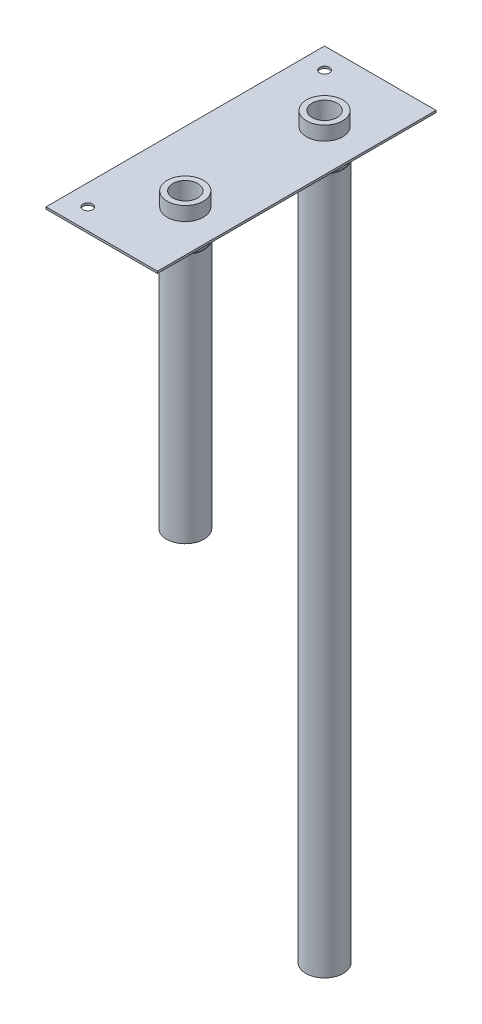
ISO-10303-21;
HEADER;
FILE_DESCRIPTION(('STEP AP214'),'2;1');
FILE_NAME('part.step','',(''),(''),'','','');
FILE_SCHEMA(('AUTOMOTIVE_DESIGN { 1 0 10303 214 1 1 1 1 }'));
ENDSEC;
DATA;
#1=APPLICATION_CONTEXT('core data for automotive mechanical design processes');
#2=APPLICATION_PROTOCOL_DEFINITION('international standard','automotive_design',2000,#1);
#3=PRODUCT_CONTEXT('',#1,'mechanical');
#4=PRODUCT('Part','Part','',(#3));
#5=PRODUCT_RELATED_PRODUCT_CATEGORY('part','',(#4));
#6=PRODUCT_DEFINITION_FORMATION('','',#4);
#7=PRODUCT_DEFINITION_CONTEXT('part definition',#1,'design');
#8=PRODUCT_DEFINITION('design','',#6,#7);
#9=PRODUCT_DEFINITION_SHAPE('','',#8);
#10=(LENGTH_UNIT() NAMED_UNIT(*) SI_UNIT(.MILLI.,.METRE.));
#11=(NAMED_UNIT(*) PLANE_ANGLE_UNIT() SI_UNIT($,.RADIAN.));
#12=(NAMED_UNIT(*) SI_UNIT($,.STERADIAN.) SOLID_ANGLE_UNIT());
#13=UNCERTAINTY_MEASURE_WITH_UNIT(LENGTH_MEASURE(1.E-05),#10,'distance_accuracy_value','');
#14=(GEOMETRIC_REPRESENTATION_CONTEXT(3) GLOBAL_UNCERTAINTY_ASSIGNED_CONTEXT((#13)) GLOBAL_UNIT_ASSIGNED_CONTEXT((#10,
#11,#12)) REPRESENTATION_CONTEXT('',''));
#15=CARTESIAN_POINT('',(0.,0.,0.));
#16=DIRECTION('',(0.,0.,1.));
#17=DIRECTION('',(1.,0.,0.));
#18=AXIS2_PLACEMENT_3D('',#15,#16,#17);
#19=CARTESIAN_POINT('',(0.,0.,-200.));
#20=DIRECTION('',(-1.,0.,0.));
#21=DIRECTION('',(0.,-1.,0.));
#22=AXIS2_PLACEMENT_3D('',#19,#20,#21);
#23=PLANE('',#22);
#24=DIRECTION('',(0.,-1.,0.));
#25=VECTOR('',#24,1.);
#26=CARTESIAN_POINT('',(0.,0.,0.));
#27=LINE('',#26,#25);
#28=CARTESIAN_POINT('',(0.,0.,0.));
#29=VERTEX_POINT('',#28);
#30=CARTESIAN_POINT('',(0.,-1.5,0.));
#31=VERTEX_POINT('',#30);
#32=EDGE_CURVE('E101',#29,#31,#27,.T.);
#33=ORIENTED_EDGE('',*,*,#32,.F.);
#34=DIRECTION('',(0.,0.,1.));
#35=VECTOR('',#34,1.);
#36=CARTESIAN_POINT('',(0.,0.,-200.));
#37=LINE('',#36,#35);
#38=CARTESIAN_POINT('',(0.,0.,-200.));
#39=VERTEX_POINT('',#38);
#40=EDGE_CURVE('E11',#39,#29,#37,.T.);
#41=ORIENTED_EDGE('',*,*,#40,.F.);
#42=DIRECTION('',(0.,-1.,0.));
#43=VECTOR('',#42,1.);
#44=CARTESIAN_POINT('',(0.,0.,-200.));
#45=LINE('',#44,#43);
#46=CARTESIAN_POINT('',(0.,-1.5,-200.));
#47=VERTEX_POINT('',#46);
#48=EDGE_CURVE('E94',#39,#47,#45,.T.);
#49=ORIENTED_EDGE('',*,*,#48,.T.);
#50=DIRECTION('',(0.,0.,1.));
#51=VECTOR('',#50,1.);
#52=CARTESIAN_POINT('',(0.,-1.5,-200.));
#53=LINE('',#52,#51);
#54=EDGE_CURVE('E39',#47,#31,#53,.T.);
#55=ORIENTED_EDGE('',*,*,#54,.T.);
#56=EDGE_LOOP('',(#33,#41,#49,#55));
#57=FACE_BOUND('',#56,.T.);
#58=ADVANCED_FACE('F36',(#57),#23,.T.);
#59=CARTESIAN_POINT('',(0.,0.,-200.));
#60=DIRECTION('',(0.,1.,0.));
#61=DIRECTION('',(0.,0.,1.));
#62=AXIS2_PLACEMENT_3D('',#59,#60,#61);
#63=PLANE('',#62);
#64=CARTESIAN_POINT('',(15.,0.,-185.));
#65=DIRECTION('',(0.,1.,0.));
#66=DIRECTION('',(0.,0.,1.));
#67=AXIS2_PLACEMENT_3D('',#64,#65,#66);
#68=CIRCLE('',#67,3.50000000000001);
#69=CARTESIAN_POINT('',(15.,0.,-181.5));
#70=VERTEX_POINT('',#69);
#71=EDGE_CURVE('E148',#70,#70,#68,.T.);
#72=ORIENTED_EDGE('',*,*,#71,.F.);
#73=EDGE_LOOP('',(#72));
#74=FACE_BOUND('',#73,.T.);
#75=CARTESIAN_POINT('',(15.,0.,-15.));
#76=DIRECTION('',(0.,1.,0.));
#77=DIRECTION('',(0.,0.,1.));
#78=AXIS2_PLACEMENT_3D('',#75,#76,#77);
#79=CIRCLE('',#78,3.5);
#80=CARTESIAN_POINT('',(15.,0.,-11.5));
#81=VERTEX_POINT('',#80);
#82=EDGE_CURVE('E157',#81,#81,#79,.T.);
#83=ORIENTED_EDGE('',*,*,#82,.F.);
#84=EDGE_LOOP('',(#83));
#85=FACE_BOUND('',#84,.T.);
#86=CARTESIAN_POINT('',(50.,0.,-150.));
#87=DIRECTION('',(0.,1.,0.));
#88=DIRECTION('',(0.,0.,1.));
#89=AXIS2_PLACEMENT_3D('',#86,#87,#88);
#90=CIRCLE('',#89,13.);
#91=CARTESIAN_POINT('',(50.,0.,-137.));
#92=VERTEX_POINT('',#91);
#93=EDGE_CURVE('E160',#92,#92,#90,.T.);
#94=ORIENTED_EDGE('',*,*,#93,.F.);
#95=EDGE_LOOP('',(#94));
#96=FACE_BOUND('',#95,.T.);
#97=CARTESIAN_POINT('',(50.,0.,-50.));
#98=DIRECTION('',(0.,1.,0.));
#99=DIRECTION('',(0.,0.,1.));
#100=AXIS2_PLACEMENT_3D('',#97,#98,#99);
#101=CIRCLE('',#100,13.);
#102=CARTESIAN_POINT('',(50.,0.,-37.));
#103=VERTEX_POINT('',#102);
#104=EDGE_CURVE('E105',#103,#103,#101,.T.);
#105=ORIENTED_EDGE('',*,*,#104,.F.);
#106=EDGE_LOOP('',(#105));
#107=FACE_BOUND('',#106,.T.);
#108=DIRECTION('',(-1.,0.,0.));
#109=VECTOR('',#108,1.);
#110=CARTESIAN_POINT('',(0.,0.,0.));
#111=LINE('',#110,#109);
#112=CARTESIAN_POINT('',(80.,0.,0.));
#113=VERTEX_POINT('',#112);
#114=EDGE_CURVE('E96',#113,#29,#111,.T.);
#115=ORIENTED_EDGE('',*,*,#114,.F.);
#116=DIRECTION('',(0.,0.,1.));
#117=VECTOR('',#116,1.);
#118=CARTESIAN_POINT('',(80.,0.,-200.));
#119=LINE('',#118,#117);
#120=CARTESIAN_POINT('',(80.,0.,-200.));
#121=VERTEX_POINT('',#120);
#122=EDGE_CURVE('E45',#121,#113,#119,.T.);
#123=ORIENTED_EDGE('',*,*,#122,.F.);
#124=DIRECTION('',(-1.,0.,0.));
#125=VECTOR('',#124,1.);
#126=CARTESIAN_POINT('',(0.,0.,-200.));
#127=LINE('',#126,#125);
#128=EDGE_CURVE('E91',#121,#39,#127,.T.);
#129=ORIENTED_EDGE('',*,*,#128,.T.);
#130=ORIENTED_EDGE('',*,*,#40,.T.);
#131=EDGE_LOOP('',(#115,#123,#129,#130));
#132=FACE_BOUND('',#131,.T.);
#133=ADVANCED_FACE('F112',(#74,#85,#96,#107,#132),#63,.T.);
#134=CARTESIAN_POINT('',(80.,-1.5,-200.));
#135=DIRECTION('',(1.,0.,0.));
#136=DIRECTION('',(0.,0.,-1.));
#137=AXIS2_PLACEMENT_3D('',#134,#135,#136);
#138=PLANE('',#137);
#139=DIRECTION('',(0.,1.,0.));
#140=VECTOR('',#139,1.);
#141=CARTESIAN_POINT('',(80.,-1.5,0.));
#142=LINE('',#141,#140);
#143=CARTESIAN_POINT('',(80.,-1.5,0.));
#144=VERTEX_POINT('',#143);
#145=EDGE_CURVE('E86',#144,#113,#142,.T.);
#146=ORIENTED_EDGE('',*,*,#145,.F.);
#147=DIRECTION('',(0.,0.,1.));
#148=VECTOR('',#147,1.);
#149=CARTESIAN_POINT('',(80.,-1.5,-200.));
#150=LINE('',#149,#148);
#151=CARTESIAN_POINT('',(80.,-1.5,-200.));
#152=VERTEX_POINT('',#151);
#153=EDGE_CURVE('E81',#152,#144,#150,.T.);
#154=ORIENTED_EDGE('',*,*,#153,.F.);
#155=DIRECTION('',(0.,1.,0.));
#156=VECTOR('',#155,1.);
#157=CARTESIAN_POINT('',(80.,-1.5,-200.));
#158=LINE('',#157,#156);
#159=EDGE_CURVE('E84',#152,#121,#158,.T.);
#160=ORIENTED_EDGE('',*,*,#159,.T.);
#161=ORIENTED_EDGE('',*,*,#122,.T.);
#162=EDGE_LOOP('',(#146,#154,#160,#161));
#163=FACE_BOUND('',#162,.T.);
#164=ADVANCED_FACE('F83',(#163),#138,.T.);
#165=CARTESIAN_POINT('',(0.,-1.5,-200.));
#166=DIRECTION('',(0.,-1.,0.));
#167=DIRECTION('',(1.,0.,0.));
#168=AXIS2_PLACEMENT_3D('',#165,#166,#167);
#169=PLANE('',#168);
#170=CARTESIAN_POINT('',(15.,-1.5,-185.));
#171=DIRECTION('',(0.,-1.,0.));
#172=DIRECTION('',(1.,0.,0.));
#173=AXIS2_PLACEMENT_3D('',#170,#171,#172);
#174=CIRCLE('',#173,3.50000000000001);
#175=CARTESIAN_POINT('',(18.5,-1.5,-185.));
#176=VERTEX_POINT('',#175);
#177=EDGE_CURVE('E133',#176,#176,#174,.F.);
#178=ORIENTED_EDGE('',*,*,#177,.T.);
#179=EDGE_LOOP('',(#178));
#180=FACE_BOUND('',#179,.T.);
#181=CARTESIAN_POINT('',(15.,-1.5,-15.));
#182=DIRECTION('',(0.,-1.,0.));
#183=DIRECTION('',(1.,0.,0.));
#184=AXIS2_PLACEMENT_3D('',#181,#182,#183);
#185=CIRCLE('',#184,3.5);
#186=CARTESIAN_POINT('',(18.5,-1.5,-15.));
#187=VERTEX_POINT('',#186);
#188=EDGE_CURVE('E137',#187,#187,#185,.F.);
#189=ORIENTED_EDGE('',*,*,#188,.T.);
#190=EDGE_LOOP('',(#189));
#191=FACE_BOUND('',#190,.T.);
#192=CARTESIAN_POINT('',(50.,-1.5,-150.));
#193=DIRECTION('',(0.,-1.,0.));
#194=DIRECTION('',(1.,0.,0.));
#195=AXIS2_PLACEMENT_3D('',#192,#193,#194);
#196=CIRCLE('',#195,13.);
#197=CARTESIAN_POINT('',(63.,-1.5,-150.));
#198=VERTEX_POINT('',#197);
#199=EDGE_CURVE('E141',#198,#198,#196,.T.);
#200=ORIENTED_EDGE('',*,*,#199,.F.);
#201=EDGE_LOOP('',(#200));
#202=FACE_BOUND('',#201,.T.);
#203=CARTESIAN_POINT('',(50.,-1.5,-50.));
#204=DIRECTION('',(0.,-1.,0.));
#205=DIRECTION('',(1.,0.,0.));
#206=AXIS2_PLACEMENT_3D('',#203,#204,#205);
#207=CIRCLE('',#206,13.);
#208=CARTESIAN_POINT('',(63.,-1.5,-50.));
#209=VERTEX_POINT('',#208);
#210=EDGE_CURVE('E144',#209,#209,#207,.T.);
#211=ORIENTED_EDGE('',*,*,#210,.F.);
#212=EDGE_LOOP('',(#211));
#213=FACE_BOUND('',#212,.T.);
#214=DIRECTION('',(1.,0.,0.));
#215=VECTOR('',#214,1.);
#216=CARTESIAN_POINT('',(0.,-1.5,0.));
#217=LINE('',#216,#215);
#218=EDGE_CURVE('E104',#31,#144,#217,.T.);
#219=ORIENTED_EDGE('',*,*,#218,.F.);
#220=ORIENTED_EDGE('',*,*,#54,.F.);
#221=DIRECTION('',(1.,0.,0.));
#222=VECTOR('',#221,1.);
#223=CARTESIAN_POINT('',(0.,-1.5,-200.));
#224=LINE('',#223,#222);
#225=EDGE_CURVE('E90',#47,#152,#224,.T.);
#226=ORIENTED_EDGE('',*,*,#225,.T.);
#227=ORIENTED_EDGE('',*,*,#153,.T.);
#228=EDGE_LOOP('',(#219,#220,#226,#227));
#229=FACE_BOUND('',#228,.T.);
#230=ADVANCED_FACE('F93',(#180,#191,#202,#213,#229),#169,.T.);
#231=CARTESIAN_POINT('',(0.,-1.5,-200.));
#232=DIRECTION('',(0.,0.,1.));
#233=DIRECTION('',(1.,0.,0.));
#234=AXIS2_PLACEMENT_3D('',#231,#232,#233);
#235=PLANE('',#234);
#236=ORIENTED_EDGE('',*,*,#48,.F.);
#237=ORIENTED_EDGE('',*,*,#128,.F.);
#238=ORIENTED_EDGE('',*,*,#159,.F.);
#239=ORIENTED_EDGE('',*,*,#225,.F.);
#240=EDGE_LOOP('',(#236,#237,#238,#239));
#241=FACE_BOUND('',#240,.T.);
#242=ADVANCED_FACE('F89',(#241),#235,.F.);
#243=CARTESIAN_POINT('',(0.,-1.5,0.));
#244=DIRECTION('',(0.,0.,1.));
#245=DIRECTION('',(1.,0.,0.));
#246=AXIS2_PLACEMENT_3D('',#243,#244,#245);
#247=PLANE('',#246);
#248=ORIENTED_EDGE('',*,*,#32,.T.);
#249=ORIENTED_EDGE('',*,*,#218,.T.);
#250=ORIENTED_EDGE('',*,*,#145,.T.);
#251=ORIENTED_EDGE('',*,*,#114,.T.);
#252=EDGE_LOOP('',(#248,#249,#250,#251));
#253=FACE_BOUND('',#252,.T.);
#254=ADVANCED_FACE('F111',(#253),#247,.T.);
#255=CARTESIAN_POINT('',(15.,-1.501,-15.));
#256=DIRECTION('',(0.,1.,0.));
#257=DIRECTION('',(0.,0.,1.));
#258=AXIS2_PLACEMENT_3D('',#255,#256,#257);
#259=CYLINDRICAL_SURFACE('',#258,3.5);
#260=ORIENTED_EDGE('',*,*,#188,.F.);
#261=EDGE_LOOP('',(#260));
#262=FACE_BOUND('',#261,.T.);
#263=ORIENTED_EDGE('',*,*,#82,.T.);
#264=EDGE_LOOP('',(#263));
#265=FACE_BOUND('',#264,.T.);
#266=ADVANCED_FACE('F287',(#262,#265),#259,.F.);
#267=CARTESIAN_POINT('',(15.,-1.501,-185.));
#268=DIRECTION('',(0.,1.,0.));
#269=DIRECTION('',(0.,0.,1.));
#270=AXIS2_PLACEMENT_3D('',#267,#268,#269);
#271=CYLINDRICAL_SURFACE('',#270,3.50000000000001);
#272=ORIENTED_EDGE('',*,*,#177,.F.);
#273=EDGE_LOOP('',(#272));
#274=FACE_BOUND('',#273,.T.);
#275=ORIENTED_EDGE('',*,*,#71,.T.);
#276=EDGE_LOOP('',(#275));
#277=FACE_BOUND('',#276,.T.);
#278=ADVANCED_FACE('F171',(#274,#277),#271,.F.);
#279=CARTESIAN_POINT('',(50.,-20.,-50.));
#280=DIRECTION('',(0.,1.,0.));
#281=DIRECTION('',(0.,0.,1.));
#282=AXIS2_PLACEMENT_3D('',#279,#280,#281);
#283=CYLINDRICAL_SURFACE('',#282,13.);
#284=ORIENTED_EDGE('',*,*,#104,.T.);
#285=EDGE_LOOP('',(#284));
#286=FACE_BOUND('',#285,.T.);
#287=CARTESIAN_POINT('',(50.,10.,-50.));
#288=DIRECTION('',(0.,1.,0.));
#289=DIRECTION('',(0.,0.,1.));
#290=AXIS2_PLACEMENT_3D('',#287,#288,#289);
#291=CIRCLE('',#290,13.);
#292=CARTESIAN_POINT('',(50.,10.,-37.));
#293=VERTEX_POINT('',#292);
#294=EDGE_CURVE('E151',#293,#293,#291,.T.);
#295=ORIENTED_EDGE('',*,*,#294,.F.);
#296=EDGE_LOOP('',(#295));
#297=FACE_BOUND('',#296,.T.);
#298=ADVANCED_FACE('F166',(#286,#297),#283,.T.);
#299=ORIENTED_EDGE('',*,*,#210,.T.);
#300=EDGE_LOOP('',(#299));
#301=FACE_BOUND('',#300,.T.);
#302=CARTESIAN_POINT('',(50.,-20.,-50.));
#303=DIRECTION('',(0.,-1.,0.));
#304=DIRECTION('',(0.,0.,-1.));
#305=AXIS2_PLACEMENT_3D('',#302,#303,#304);
#306=CIRCLE('',#305,13.);
#307=CARTESIAN_POINT('',(50.,-20.,-63.));
#308=VERTEX_POINT('',#307);
#309=EDGE_CURVE('E190',#308,#308,#306,.F.);
#310=ORIENTED_EDGE('',*,*,#309,.T.);
#311=EDGE_LOOP('',(#310));
#312=FACE_BOUND('',#311,.T.);
#313=ADVANCED_FACE('F170',(#301,#312),#283,.T.);
#314=CARTESIAN_POINT('',(50.,-20.,-50.));
#315=DIRECTION('',(0.,1.,0.));
#316=DIRECTION('',(0.,0.,1.));
#317=AXIS2_PLACEMENT_3D('',#314,#315,#316);
#318=PLANE('',#317);
#319=CARTESIAN_POINT('',(50.,-20.,-50.));
#320=DIRECTION('',(0.,-1.,0.));
#321=DIRECTION('',(0.,0.,-1.));
#322=AXIS2_PLACEMENT_3D('',#319,#320,#321);
#323=CIRCLE('',#322,10.85);
#324=CARTESIAN_POINT('',(50.,-20.,-39.15));
#325=VERTEX_POINT('',#324);
#326=EDGE_CURVE('E200',#325,#325,#323,.T.);
#327=ORIENTED_EDGE('',*,*,#326,.T.);
#328=EDGE_LOOP('',(#327));
#329=FACE_BOUND('',#328,.T.);
#330=CARTESIAN_POINT('',(50.,-20.,-50.));
#331=DIRECTION('',(0.,1.,0.));
#332=DIRECTION('',(0.,0.,1.));
#333=AXIS2_PLACEMENT_3D('',#330,#331,#332);
#334=CIRCLE('',#333,9.);
#335=CARTESIAN_POINT('',(50.,-20.,-41.));
#336=VERTEX_POINT('',#335);
#337=EDGE_CURVE('E146',#336,#336,#334,.T.);
#338=ORIENTED_EDGE('',*,*,#337,.T.);
#339=EDGE_LOOP('',(#338));
#340=FACE_BOUND('',#339,.T.);
#341=ADVANCED_FACE('F279',(#329,#340),#318,.F.);
#342=CARTESIAN_POINT('',(50.,-20.,-50.));
#343=DIRECTION('',(0.,1.,0.));
#344=DIRECTION('',(0.,0.,1.));
#345=AXIS2_PLACEMENT_3D('',#342,#343,#344);
#346=CYLINDRICAL_SURFACE('',#345,9.);
#347=ORIENTED_EDGE('',*,*,#337,.F.);
#348=EDGE_LOOP('',(#347));
#349=FACE_BOUND('',#348,.T.);
#350=CARTESIAN_POINT('',(50.,10.,-50.));
#351=DIRECTION('',(0.,1.,0.));
#352=DIRECTION('',(0.,0.,1.));
#353=AXIS2_PLACEMENT_3D('',#350,#351,#352);
#354=CIRCLE('',#353,9.);
#355=CARTESIAN_POINT('',(50.,10.,-41.));
#356=VERTEX_POINT('',#355);
#357=EDGE_CURVE('E176',#356,#356,#354,.T.);
#358=ORIENTED_EDGE('',*,*,#357,.T.);
#359=EDGE_LOOP('',(#358));
#360=FACE_BOUND('',#359,.T.);
#361=ADVANCED_FACE('F276',(#349,#360),#346,.F.);
#362=CARTESIAN_POINT('',(50.,10.,-50.));
#363=DIRECTION('',(0.,1.,0.));
#364=DIRECTION('',(0.,0.,1.));
#365=AXIS2_PLACEMENT_3D('',#362,#363,#364);
#366=PLANE('',#365);
#367=ORIENTED_EDGE('',*,*,#294,.T.);
#368=EDGE_LOOP('',(#367));
#369=FACE_BOUND('',#368,.T.);
#370=ORIENTED_EDGE('',*,*,#357,.F.);
#371=EDGE_LOOP('',(#370));
#372=FACE_BOUND('',#371,.T.);
#373=ADVANCED_FACE('F273',(#369,#372),#366,.T.);
#374=CARTESIAN_POINT('',(50.,-20.,-150.));
#375=DIRECTION('',(0.,1.,0.));
#376=DIRECTION('',(0.,0.,1.));
#377=AXIS2_PLACEMENT_3D('',#374,#375,#376);
#378=CYLINDRICAL_SURFACE('',#377,13.);
#379=ORIENTED_EDGE('',*,*,#93,.T.);
#380=EDGE_LOOP('',(#379));
#381=FACE_BOUND('',#380,.T.);
#382=CARTESIAN_POINT('',(50.,10.,-150.));
#383=DIRECTION('',(0.,1.,0.));
#384=DIRECTION('',(0.,0.,1.));
#385=AXIS2_PLACEMENT_3D('',#382,#383,#384);
#386=CIRCLE('',#385,13.);
#387=CARTESIAN_POINT('',(50.,10.,-137.));
#388=VERTEX_POINT('',#387);
#389=EDGE_CURVE('E184',#388,#388,#386,.T.);
#390=ORIENTED_EDGE('',*,*,#389,.F.);
#391=EDGE_LOOP('',(#390));
#392=FACE_BOUND('',#391,.T.);
#393=ADVANCED_FACE('F271',(#381,#392),#378,.T.);
#394=ORIENTED_EDGE('',*,*,#199,.T.);
#395=EDGE_LOOP('',(#394));
#396=FACE_BOUND('',#395,.T.);
#397=CARTESIAN_POINT('',(50.,-20.,-150.));
#398=DIRECTION('',(0.,-1.,0.));
#399=DIRECTION('',(0.,0.,-1.));
#400=AXIS2_PLACEMENT_3D('',#397,#398,#399);
#401=CIRCLE('',#400,13.);
#402=CARTESIAN_POINT('',(50.,-20.,-163.));
#403=VERTEX_POINT('',#402);
#404=EDGE_CURVE('E203',#403,#403,#401,.F.);
#405=ORIENTED_EDGE('',*,*,#404,.T.);
#406=EDGE_LOOP('',(#405));
#407=FACE_BOUND('',#406,.T.);
#408=ADVANCED_FACE('F267',(#396,#407),#378,.T.);
#409=CARTESIAN_POINT('',(50.,-20.,-150.));
#410=DIRECTION('',(0.,1.,0.));
#411=DIRECTION('',(0.,0.,1.));
#412=AXIS2_PLACEMENT_3D('',#409,#410,#411);
#413=PLANE('',#412);
#414=CARTESIAN_POINT('',(50.,-20.,-150.));
#415=DIRECTION('',(0.,-1.,0.));
#416=DIRECTION('',(0.,0.,-1.));
#417=AXIS2_PLACEMENT_3D('',#414,#415,#416);
#418=CIRCLE('',#417,10.85);
#419=CARTESIAN_POINT('',(50.,-20.,-160.85));
#420=VERTEX_POINT('',#419);
#421=EDGE_CURVE('E215',#420,#420,#418,.T.);
#422=ORIENTED_EDGE('',*,*,#421,.T.);
#423=EDGE_LOOP('',(#422));
#424=FACE_BOUND('',#423,.T.);
#425=CARTESIAN_POINT('',(50.,-20.,-150.));
#426=DIRECTION('',(0.,1.,0.));
#427=DIRECTION('',(0.,0.,1.));
#428=AXIS2_PLACEMENT_3D('',#425,#426,#427);
#429=CIRCLE('',#428,9.00000000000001);
#430=CARTESIAN_POINT('',(50.,-20.,-141.));
#431=VERTEX_POINT('',#430);
#432=EDGE_CURVE('E181',#431,#431,#429,.T.);
#433=ORIENTED_EDGE('',*,*,#432,.T.);
#434=EDGE_LOOP('',(#433));
#435=FACE_BOUND('',#434,.T.);
#436=ADVANCED_FACE('F263',(#424,#435),#413,.F.);
#437=CARTESIAN_POINT('',(50.,-20.,-150.));
#438=DIRECTION('',(0.,1.,0.));
#439=DIRECTION('',(0.,0.,1.));
#440=AXIS2_PLACEMENT_3D('',#437,#438,#439);
#441=CYLINDRICAL_SURFACE('',#440,9.00000000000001);
#442=ORIENTED_EDGE('',*,*,#432,.F.);
#443=EDGE_LOOP('',(#442));
#444=FACE_BOUND('',#443,.T.);
#445=CARTESIAN_POINT('',(50.,10.,-150.));
#446=DIRECTION('',(0.,1.,0.));
#447=DIRECTION('',(0.,0.,1.));
#448=AXIS2_PLACEMENT_3D('',#445,#446,#447);
#449=CIRCLE('',#448,9.00000000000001);
#450=CARTESIAN_POINT('',(50.,10.,-141.));
#451=VERTEX_POINT('',#450);
#452=EDGE_CURVE('E187',#451,#451,#449,.T.);
#453=ORIENTED_EDGE('',*,*,#452,.T.);
#454=EDGE_LOOP('',(#453));
#455=FACE_BOUND('',#454,.T.);
#456=ADVANCED_FACE('F259',(#444,#455),#441,.F.);
#457=CARTESIAN_POINT('',(50.,10.,-150.));
#458=DIRECTION('',(0.,1.,0.));
#459=DIRECTION('',(0.,0.,1.));
#460=AXIS2_PLACEMENT_3D('',#457,#458,#459);
#461=PLANE('',#460);
#462=ORIENTED_EDGE('',*,*,#389,.T.);
#463=EDGE_LOOP('',(#462));
#464=FACE_BOUND('',#463,.T.);
#465=ORIENTED_EDGE('',*,*,#452,.F.);
#466=EDGE_LOOP('',(#465));
#467=FACE_BOUND('',#466,.T.);
#468=ADVANCED_FACE('F249',(#464,#467),#461,.T.);
#469=CARTESIAN_POINT('',(50.,-200.,-50.));
#470=DIRECTION('',(0.,-1.,0.));
#471=DIRECTION('',(0.,0.,-1.));
#472=AXIS2_PLACEMENT_3D('',#469,#470,#471);
#473=PLANE('',#472);
#474=CARTESIAN_POINT('',(50.,-200.,-50.));
#475=DIRECTION('',(0.,-1.,0.));
#476=DIRECTION('',(0.,0.,-1.));
#477=AXIS2_PLACEMENT_3D('',#474,#475,#476);
#478=CIRCLE('',#477,13.45);
#479=CARTESIAN_POINT('',(50.,-200.,-36.55));
#480=VERTEX_POINT('',#479);
#481=EDGE_CURVE('E193',#480,#480,#478,.T.);
#482=ORIENTED_EDGE('',*,*,#481,.T.);
#483=EDGE_LOOP('',(#482));
#484=FACE_BOUND('',#483,.T.);
#485=CARTESIAN_POINT('',(50.,-200.,-50.));
#486=DIRECTION('',(0.,-1.,0.));
#487=DIRECTION('',(0.,0.,-1.));
#488=AXIS2_PLACEMENT_3D('',#485,#486,#487);
#489=CIRCLE('',#488,10.85);
#490=CARTESIAN_POINT('',(50.,-200.,-39.15));
#491=VERTEX_POINT('',#490);
#492=EDGE_CURVE('E197',#491,#491,#489,.T.);
#493=ORIENTED_EDGE('',*,*,#492,.F.);
#494=EDGE_LOOP('',(#493));
#495=FACE_BOUND('',#494,.T.);
#496=ADVANCED_FACE('F245',(#484,#495),#473,.T.);
#497=CARTESIAN_POINT('',(50.,-20.,-50.));
#498=DIRECTION('',(0.,-1.,0.));
#499=DIRECTION('',(0.,0.,-1.));
#500=AXIS2_PLACEMENT_3D('',#497,#498,#499);
#501=PLANE('',#500);
#502=ORIENTED_EDGE('',*,*,#309,.F.);
#503=EDGE_LOOP('',(#502));
#504=FACE_BOUND('',#503,.T.);
#505=CARTESIAN_POINT('',(50.,-20.,-50.));
#506=DIRECTION('',(0.,-1.,0.));
#507=DIRECTION('',(0.,0.,-1.));
#508=AXIS2_PLACEMENT_3D('',#505,#506,#507);
#509=CIRCLE('',#508,13.45);
#510=CARTESIAN_POINT('',(50.,-20.,-36.55));
#511=VERTEX_POINT('',#510);
#512=EDGE_CURVE('E194',#511,#511,#509,.T.);
#513=ORIENTED_EDGE('',*,*,#512,.F.);
#514=EDGE_LOOP('',(#513));
#515=FACE_BOUND('',#514,.T.);
#516=ADVANCED_FACE('F248',(#504,#515),#501,.F.);
#517=CARTESIAN_POINT('',(50.,-200.,-50.));
#518=DIRECTION('',(0.,1.,0.));
#519=DIRECTION('',(0.,0.,1.));
#520=AXIS2_PLACEMENT_3D('',#517,#518,#519);
#521=CYLINDRICAL_SURFACE('',#520,13.45);
#522=CARTESIAN_POINT('',(50.,-200.,-36.55));
#523=CARTESIAN_POINT('',(50.,-198.125,-36.55));
#524=CARTESIAN_POINT('',(50.,-196.25,-36.55));
#525=CARTESIAN_POINT('',(50.,-192.5,-36.55));
#526=CARTESIAN_POINT('',(50.,-190.625,-36.55));
#527=CARTESIAN_POINT('',(50.,-186.875,-36.55));
#528=CARTESIAN_POINT('',(50.,-185.,-36.55));
#529=CARTESIAN_POINT('',(50.,-181.25,-36.55));
#530=CARTESIAN_POINT('',(50.,-179.375,-36.55));
#531=CARTESIAN_POINT('',(50.,-175.625,-36.55));
#532=CARTESIAN_POINT('',(50.,-173.75,-36.55));
#533=CARTESIAN_POINT('',(50.,-170.,-36.55));
#534=CARTESIAN_POINT('',(50.,-168.125,-36.55));
#535=CARTESIAN_POINT('',(50.,-164.375,-36.55));
#536=CARTESIAN_POINT('',(50.,-162.5,-36.55));
#537=CARTESIAN_POINT('',(50.,-158.75,-36.55));
#538=CARTESIAN_POINT('',(50.,-156.875,-36.55));
#539=CARTESIAN_POINT('',(50.,-153.125,-36.55));
#540=CARTESIAN_POINT('',(50.,-151.25,-36.55));
#541=CARTESIAN_POINT('',(50.,-147.5,-36.55));
#542=CARTESIAN_POINT('',(50.,-145.625,-36.55));
#543=CARTESIAN_POINT('',(50.,-141.875,-36.55));
#544=CARTESIAN_POINT('',(50.,-140.,-36.55));
#545=CARTESIAN_POINT('',(50.,-136.25,-36.55));
#546=CARTESIAN_POINT('',(50.,-134.375,-36.55));
#547=CARTESIAN_POINT('',(50.,-130.625,-36.55));
#548=CARTESIAN_POINT('',(50.,-128.75,-36.55));
#549=CARTESIAN_POINT('',(50.,-125.,-36.55));
#550=CARTESIAN_POINT('',(50.,-123.125,-36.55));
#551=CARTESIAN_POINT('',(50.,-119.375,-36.55));
#552=CARTESIAN_POINT('',(50.,-117.5,-36.55));
#553=CARTESIAN_POINT('',(50.,-113.75,-36.55));
#554=CARTESIAN_POINT('',(50.,-111.875,-36.55));
#555=CARTESIAN_POINT('',(50.,-108.125,-36.55));
#556=CARTESIAN_POINT('',(50.,-106.25,-36.55));
#557=CARTESIAN_POINT('',(50.,-102.5,-36.55));
#558=CARTESIAN_POINT('',(50.,-100.625,-36.55));
#559=CARTESIAN_POINT('',(50.,-96.875,-36.55));
#560=CARTESIAN_POINT('',(50.,-95.,-36.55));
#561=CARTESIAN_POINT('',(50.,-91.25,-36.55));
#562=CARTESIAN_POINT('',(50.,-89.375,-36.55));
#563=CARTESIAN_POINT('',(50.,-85.625,-36.55));
#564=CARTESIAN_POINT('',(50.,-83.75,-36.55));
#565=CARTESIAN_POINT('',(50.,-80.,-36.55));
#566=CARTESIAN_POINT('',(50.,-78.125,-36.55));
#567=CARTESIAN_POINT('',(50.,-74.375,-36.55));
#568=CARTESIAN_POINT('',(50.,-72.5,-36.55));
#569=CARTESIAN_POINT('',(50.,-68.75,-36.55));
#570=CARTESIAN_POINT('',(50.,-66.875,-36.55));
#571=CARTESIAN_POINT('',(50.,-63.125,-36.55));
#572=CARTESIAN_POINT('',(50.,-61.25,-36.55));
#573=CARTESIAN_POINT('',(50.,-57.5,-36.55));
#574=CARTESIAN_POINT('',(50.,-55.625,-36.55));
#575=CARTESIAN_POINT('',(50.,-51.875,-36.55));
#576=CARTESIAN_POINT('',(50.,-50.,-36.55));
#577=CARTESIAN_POINT('',(50.,-46.25,-36.55));
#578=CARTESIAN_POINT('',(50.,-44.375,-36.55));
#579=CARTESIAN_POINT('',(50.,-40.625,-36.55));
#580=CARTESIAN_POINT('',(50.,-38.75,-36.55));
#581=CARTESIAN_POINT('',(50.,-35.,-36.55));
#582=CARTESIAN_POINT('',(50.,-33.125,-36.55));
#583=CARTESIAN_POINT('',(50.,-29.375,-36.55));
#584=CARTESIAN_POINT('',(50.,-27.5,-36.55));
#585=CARTESIAN_POINT('',(50.,-23.75,-36.55));
#586=CARTESIAN_POINT('',(50.,-21.875,-36.55));
#587=CARTESIAN_POINT('',(50.,-20.,-36.55));
#588=B_SPLINE_CURVE_WITH_KNOTS('',3,(#522,#523,#524,#525,#526,#527,#528,#529,#530,#531,#532,
#533,#534,#535,#536,#537,#538,#539,#540,#541,#542,#543,#544,#545,#546,#547,#548,#549,#550,#551,
#552,#553,#554,#555,#556,#557,#558,#559,#560,#561,#562,#563,#564,#565,#566,#567,#568,#569,#570,
#571,#572,#573,#574,#575,#576,#577,#578,#579,#580,#581,#582,#583,#584,#585,#586,#587),
.UNSPECIFIED.,.F.,.F.,(4,2,2,2,2,2,2,2,2,2,2,2,2,2,2,2,2,2,2,2,2,2,2,2,2,2,2,2,2,2,2,2,4),(0.,
5.62500000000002,11.25,16.875,22.5,28.125,33.75,39.375,45.,50.625,56.25,61.875,67.5,73.125,
78.75,84.375,90.,95.625,101.25,106.875,112.5,118.125,123.75,129.375,135.,140.625,146.25,151.875,
157.5,163.125,168.75,174.375,180.),.UNSPECIFIED.);
#589=EDGE_CURVE('BSEAM237',#480,#511,#588,.T.);
#590=ORIENTED_EDGE('',*,*,#481,.F.);
#591=ORIENTED_EDGE('',*,*,#512,.T.);
#592=ORIENTED_EDGE('',*,*,#589,.T.);
#593=ORIENTED_EDGE('',*,*,#589,.F.);
#594=EDGE_LOOP('',(#590,#592,#591,#593));
#595=FACE_BOUND('',#594,.T.);
#596=ADVANCED_FACE('F237',(#595),#521,.T.);
#597=CARTESIAN_POINT('',(50.,-200.,-50.));
#598=DIRECTION('',(0.,1.,0.));
#599=DIRECTION('',(0.,0.,1.));
#600=AXIS2_PLACEMENT_3D('',#597,#598,#599);
#601=CYLINDRICAL_SURFACE('',#600,10.85);
#602=CARTESIAN_POINT('',(50.,-200.,-39.15));
#603=CARTESIAN_POINT('',(50.,-198.125,-39.15));
#604=CARTESIAN_POINT('',(50.,-196.25,-39.15));
#605=CARTESIAN_POINT('',(50.,-192.5,-39.15));
#606=CARTESIAN_POINT('',(50.,-190.625,-39.15));
#607=CARTESIAN_POINT('',(50.,-186.875,-39.15));
#608=CARTESIAN_POINT('',(50.,-185.,-39.15));
#609=CARTESIAN_POINT('',(50.,-181.25,-39.15));
#610=CARTESIAN_POINT('',(50.,-179.375,-39.15));
#611=CARTESIAN_POINT('',(50.,-175.625,-39.15));
#612=CARTESIAN_POINT('',(50.,-173.75,-39.15));
#613=CARTESIAN_POINT('',(50.,-170.,-39.15));
#614=CARTESIAN_POINT('',(50.,-168.125,-39.15));
#615=CARTESIAN_POINT('',(50.,-164.375,-39.15));
#616=CARTESIAN_POINT('',(50.,-162.5,-39.15));
#617=CARTESIAN_POINT('',(50.,-158.75,-39.15));
#618=CARTESIAN_POINT('',(50.,-156.875,-39.15));
#619=CARTESIAN_POINT('',(50.,-153.125,-39.15));
#620=CARTESIAN_POINT('',(50.,-151.25,-39.15));
#621=CARTESIAN_POINT('',(50.,-147.5,-39.15));
#622=CARTESIAN_POINT('',(50.,-145.625,-39.15));
#623=CARTESIAN_POINT('',(50.,-141.875,-39.15));
#624=CARTESIAN_POINT('',(50.,-140.,-39.15));
#625=CARTESIAN_POINT('',(50.,-136.25,-39.15));
#626=CARTESIAN_POINT('',(50.,-134.375,-39.15));
#627=CARTESIAN_POINT('',(50.,-130.625,-39.15));
#628=CARTESIAN_POINT('',(50.,-128.75,-39.15));
#629=CARTESIAN_POINT('',(50.,-125.,-39.15));
#630=CARTESIAN_POINT('',(50.,-123.125,-39.15));
#631=CARTESIAN_POINT('',(50.,-119.375,-39.15));
#632=CARTESIAN_POINT('',(50.,-117.5,-39.15));
#633=CARTESIAN_POINT('',(50.,-113.75,-39.15));
#634=CARTESIAN_POINT('',(50.,-111.875,-39.15));
#635=CARTESIAN_POINT('',(50.,-108.125,-39.15));
#636=CARTESIAN_POINT('',(50.,-106.25,-39.15));
#637=CARTESIAN_POINT('',(50.,-102.5,-39.15));
#638=CARTESIAN_POINT('',(50.,-100.625,-39.15));
#639=CARTESIAN_POINT('',(50.,-96.875,-39.15));
#640=CARTESIAN_POINT('',(50.,-95.,-39.15));
#641=CARTESIAN_POINT('',(50.,-91.25,-39.15));
#642=CARTESIAN_POINT('',(50.,-89.375,-39.15));
#643=CARTESIAN_POINT('',(50.,-85.625,-39.15));
#644=CARTESIAN_POINT('',(50.,-83.75,-39.15));
#645=CARTESIAN_POINT('',(50.,-80.,-39.15));
#646=CARTESIAN_POINT('',(50.,-78.125,-39.15));
#647=CARTESIAN_POINT('',(50.,-74.375,-39.15));
#648=CARTESIAN_POINT('',(50.,-72.5,-39.15));
#649=CARTESIAN_POINT('',(50.,-68.75,-39.15));
#650=CARTESIAN_POINT('',(50.,-66.875,-39.15));
#651=CARTESIAN_POINT('',(50.,-63.125,-39.15));
#652=CARTESIAN_POINT('',(50.,-61.25,-39.15));
#653=CARTESIAN_POINT('',(50.,-57.5,-39.15));
#654=CARTESIAN_POINT('',(50.,-55.625,-39.15));
#655=CARTESIAN_POINT('',(50.,-51.875,-39.15));
#656=CARTESIAN_POINT('',(50.,-50.,-39.15));
#657=CARTESIAN_POINT('',(50.,-46.25,-39.15));
#658=CARTESIAN_POINT('',(50.,-44.375,-39.15));
#659=CARTESIAN_POINT('',(50.,-40.625,-39.15));
#660=CARTESIAN_POINT('',(50.,-38.75,-39.15));
#661=CARTESIAN_POINT('',(50.,-35.,-39.15));
#662=CARTESIAN_POINT('',(50.,-33.125,-39.15));
#663=CARTESIAN_POINT('',(50.,-29.375,-39.15));
#664=CARTESIAN_POINT('',(50.,-27.5,-39.15));
#665=CARTESIAN_POINT('',(50.,-23.75,-39.15));
#666=CARTESIAN_POINT('',(50.,-21.875,-39.15));
#667=CARTESIAN_POINT('',(50.,-20.,-39.15));
#668=B_SPLINE_CURVE_WITH_KNOTS('',3,(#602,#603,#604,#605,#606,#607,#608,#609,#610,#611,#612,
#613,#614,#615,#616,#617,#618,#619,#620,#621,#622,#623,#624,#625,#626,#627,#628,#629,#630,#631,
#632,#633,#634,#635,#636,#637,#638,#639,#640,#641,#642,#643,#644,#645,#646,#647,#648,#649,#650,
#651,#652,#653,#654,#655,#656,#657,#658,#659,#660,#661,#662,#663,#664,#665,#666,#667),
.UNSPECIFIED.,.F.,.F.,(4,2,2,2,2,2,2,2,2,2,2,2,2,2,2,2,2,2,2,2,2,2,2,2,2,2,2,2,2,2,2,2,4),(0.,
5.62500000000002,11.25,16.875,22.5,28.125,33.75,39.375,45.,50.625,56.25,61.875,67.5,73.125,
78.75,84.375,90.,95.625,101.25,106.875,112.5,118.125,123.75,129.375,135.,140.625,146.25,151.875,
157.5,163.125,168.75,174.375,180.),.UNSPECIFIED.);
#669=EDGE_CURVE('BSEAM227',#491,#325,#668,.T.);
#670=ORIENTED_EDGE('',*,*,#492,.T.);
#671=ORIENTED_EDGE('',*,*,#326,.F.);
#672=ORIENTED_EDGE('',*,*,#669,.T.);
#673=ORIENTED_EDGE('',*,*,#669,.F.);
#674=EDGE_LOOP('',(#670,#672,#671,#673));
#675=FACE_BOUND('',#674,.T.);
#676=ADVANCED_FACE('F227',(#675),#601,.F.);
#677=CARTESIAN_POINT('',(50.,-520.,-150.));
#678=DIRECTION('',(0.,-1.,0.));
#679=DIRECTION('',(0.,0.,-1.));
#680=AXIS2_PLACEMENT_3D('',#677,#678,#679);
#681=PLANE('',#680);
#682=CARTESIAN_POINT('',(50.,-520.,-150.));
#683=DIRECTION('',(0.,-1.,0.));
#684=DIRECTION('',(0.,0.,-1.));
#685=AXIS2_PLACEMENT_3D('',#682,#683,#684);
#686=CIRCLE('',#685,13.45);
#687=CARTESIAN_POINT('',(50.,-520.,-163.45));
#688=VERTEX_POINT('',#687);
#689=EDGE_CURVE('E208',#688,#688,#686,.T.);
#690=ORIENTED_EDGE('',*,*,#689,.T.);
#691=EDGE_LOOP('',(#690));
#692=FACE_BOUND('',#691,.T.);
#693=CARTESIAN_POINT('',(50.,-520.,-150.));
#694=DIRECTION('',(0.,-1.,0.));
#695=DIRECTION('',(0.,0.,-1.));
#696=AXIS2_PLACEMENT_3D('',#693,#694,#695);
#697=CIRCLE('',#696,10.85);
#698=CARTESIAN_POINT('',(50.,-520.,-160.85));
#699=VERTEX_POINT('',#698);
#700=EDGE_CURVE('E212',#699,#699,#697,.T.);
#701=ORIENTED_EDGE('',*,*,#700,.F.);
#702=EDGE_LOOP('',(#701));
#703=FACE_BOUND('',#702,.T.);
#704=ADVANCED_FACE('F224',(#692,#703),#681,.T.);
#705=CARTESIAN_POINT('',(50.,-20.,-150.));
#706=DIRECTION('',(0.,-1.,0.));
#707=DIRECTION('',(0.,0.,-1.));
#708=AXIS2_PLACEMENT_3D('',#705,#706,#707);
#709=PLANE('',#708);
#710=ORIENTED_EDGE('',*,*,#404,.F.);
#711=EDGE_LOOP('',(#710));
#712=FACE_BOUND('',#711,.T.);
#713=CARTESIAN_POINT('',(50.,-20.,-150.));
#714=DIRECTION('',(0.,-1.,0.));
#715=DIRECTION('',(0.,0.,-1.));
#716=AXIS2_PLACEMENT_3D('',#713,#714,#715);
#717=CIRCLE('',#716,13.45);
#718=CARTESIAN_POINT('',(50.,-20.,-163.45));
#719=VERTEX_POINT('',#718);
#720=EDGE_CURVE('E209',#719,#719,#717,.T.);
#721=ORIENTED_EDGE('',*,*,#720,.F.);
#722=EDGE_LOOP('',(#721));
#723=FACE_BOUND('',#722,.T.);
#724=ADVANCED_FACE('F226',(#712,#723),#709,.F.);
#725=CARTESIAN_POINT('',(50.,-520.,-150.));
#726=DIRECTION('',(0.,1.,0.));
#727=DIRECTION('',(0.,0.,1.));
#728=AXIS2_PLACEMENT_3D('',#725,#726,#727);
#729=CYLINDRICAL_SURFACE('',#728,13.45);
#730=ORIENTED_EDGE('',*,*,#689,.F.);
#731=EDGE_LOOP('',(#730));
#732=FACE_BOUND('',#731,.T.);
#733=ORIENTED_EDGE('',*,*,#720,.T.);
#734=EDGE_LOOP('',(#733));
#735=FACE_BOUND('',#734,.T.);
#736=ADVANCED_FACE('F234',(#732,#735),#729,.T.);
#737=CARTESIAN_POINT('',(50.,-520.,-150.));
#738=DIRECTION('',(0.,1.,0.));
#739=DIRECTION('',(0.,0.,1.));
#740=AXIS2_PLACEMENT_3D('',#737,#738,#739);
#741=CYLINDRICAL_SURFACE('',#740,10.85);
#742=ORIENTED_EDGE('',*,*,#700,.T.);
#743=EDGE_LOOP('',(#742));
#744=FACE_BOUND('',#743,.T.);
#745=ORIENTED_EDGE('',*,*,#421,.F.);
#746=EDGE_LOOP('',(#745));
#747=FACE_BOUND('',#746,.T.);
#748=ADVANCED_FACE('F221',(#744,#747),#741,.F.);
#749=CLOSED_SHELL('',(#58,#133,#164,#230,#242,#254,#266,#278,#298,#313,#341,#361,#373,#393,#408,
#436,#456,#468,#496,#516,#596,#676,#704,#724,#736,#748));
#750=MANIFOLD_SOLID_BREP('B2',#749);
#751=ADVANCED_BREP_SHAPE_REPRESENTATION('',(#18,#750),#14);
#752=SHAPE_DEFINITION_REPRESENTATION(#9,#751);
ENDSEC;
END-ISO-10303-21;
